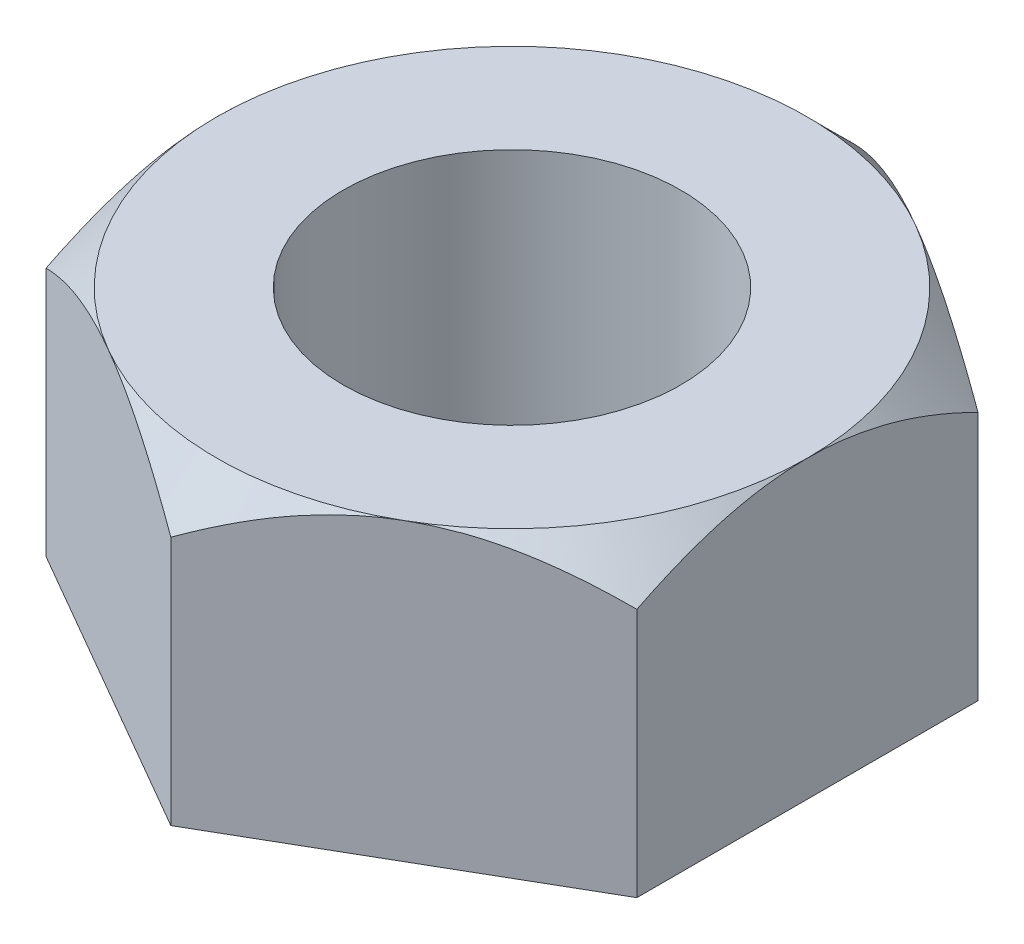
ISO-10303-21;
HEADER;
FILE_DESCRIPTION(('STEP AP214'),'2;1');
FILE_NAME('part.step','',(''),(''),'','','');
FILE_SCHEMA(('AUTOMOTIVE_DESIGN { 1 0 10303 214 1 1 1 1 }'));
ENDSEC;
DATA;
#1=APPLICATION_CONTEXT('core data for automotive mechanical design processes');
#2=APPLICATION_PROTOCOL_DEFINITION('international standard','automotive_design',2000,#1);
#3=PRODUCT_CONTEXT('',#1,'mechanical');
#4=PRODUCT('Part','Part','',(#3));
#5=PRODUCT_RELATED_PRODUCT_CATEGORY('part','',(#4));
#6=PRODUCT_DEFINITION_FORMATION('','',#4);
#7=PRODUCT_DEFINITION_CONTEXT('part definition',#1,'design');
#8=PRODUCT_DEFINITION('design','',#6,#7);
#9=PRODUCT_DEFINITION_SHAPE('','',#8);
#10=(LENGTH_UNIT() NAMED_UNIT(*) SI_UNIT(.MILLI.,.METRE.));
#11=(NAMED_UNIT(*) PLANE_ANGLE_UNIT() SI_UNIT($,.RADIAN.));
#12=(NAMED_UNIT(*) SI_UNIT($,.STERADIAN.) SOLID_ANGLE_UNIT());
#13=UNCERTAINTY_MEASURE_WITH_UNIT(LENGTH_MEASURE(1.E-05),#10,'distance_accuracy_value','');
#14=(GEOMETRIC_REPRESENTATION_CONTEXT(3) GLOBAL_UNCERTAINTY_ASSIGNED_CONTEXT((#13)) GLOBAL_UNIT_ASSIGNED_CONTEXT((#10,
#11,#12)) REPRESENTATION_CONTEXT('',''));
#15=CARTESIAN_POINT('',(0.,0.,0.));
#16=DIRECTION('',(0.,0.,1.));
#17=DIRECTION('',(1.,0.,0.));
#18=AXIS2_PLACEMENT_3D('',#15,#16,#17);
#19=CARTESIAN_POINT('',(5.5562499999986,5.55624999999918,-3.20790243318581));
#20=DIRECTION('',(-0.500000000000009,0.,0.866025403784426));
#21=DIRECTION('',(0.866025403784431,0.,0.499999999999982));
#22=AXIS2_PLACEMENT_3D('',#19,#20,#21);
#23=PLANE('',#22);
#24=CARTESIAN_POINT('',(5.5564499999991,4.69657966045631,-3.20778696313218));
#25=CARTESIAN_POINT('',(5.46091343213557,4.75173242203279,-3.26294502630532));
#26=CARTESIAN_POINT('',(5.36464252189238,4.80519263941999,-3.31852706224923));
#27=CARTESIAN_POINT('',(5.17048794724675,4.90821311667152,-3.43062225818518));
#28=CARTESIAN_POINT('',(5.07260343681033,4.95777124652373,-3.48713590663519));
#29=CARTESIAN_POINT('',(4.77540401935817,5.10024281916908,-3.65872407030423));
#30=CARTESIAN_POINT('',(4.57357316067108,5.18634564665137,-3.77525117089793));
#31=CARTESIAN_POINT('',(4.16656508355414,5.3337908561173,-4.01023739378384));
#32=CARTESIAN_POINT('',(3.96149189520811,5.39550470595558,-4.12863645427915));
#33=CARTESIAN_POINT('',(3.65051060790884,5.4668925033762,-4.30818158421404));
#34=CARTESIAN_POINT('',(3.54639232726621,5.48714839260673,-4.36829430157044));
#35=CARTESIAN_POINT('',(3.33727417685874,5.52014080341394,-4.48902872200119));
#36=CARTESIAN_POINT('',(3.23227444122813,5.53287844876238,-4.54965034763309));
#37=CARTESIAN_POINT('',(2.97640553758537,5.55423487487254,-4.69737632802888));
#38=CARTESIAN_POINT('',(2.82526068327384,5.55871592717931,-4.7846398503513));
#39=CARTESIAN_POINT('',(2.52324337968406,5.55119519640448,-4.95900962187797));
#40=CARTESIAN_POINT('',(2.37237104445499,5.53918763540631,-5.04611580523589));
#41=CARTESIAN_POINT('',(2.07204876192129,5.49939747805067,-5.2195069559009));
#42=CARTESIAN_POINT('',(1.92260059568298,5.47159724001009,-5.30579089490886));
#43=CARTESIAN_POINT('',(1.62627290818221,5.40173312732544,-5.47687576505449));
#44=CARTESIAN_POINT('',(1.4793931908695,5.35967034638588,-5.56167680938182));
#45=CARTESIAN_POINT('',(1.21865351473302,5.2731336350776,-5.71221493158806));
#46=CARTESIAN_POINT('',(1.10421623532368,5.23093545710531,-5.77828532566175));
#47=CARTESIAN_POINT('',(0.877395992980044,5.13973889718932,-5.90924005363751));
#48=CARTESIAN_POINT('',(0.765013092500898,5.09074030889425,-5.97412435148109));
#49=CARTESIAN_POINT('',(0.542655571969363,4.98704132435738,-6.10250252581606));
#50=CARTESIAN_POINT('',(0.432674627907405,4.93235885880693,-6.16600005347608));
#51=CARTESIAN_POINT('',(0.214749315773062,4.81801006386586,-6.29181929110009));
#52=CARTESIAN_POINT('',(0.106803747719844,4.75834679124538,-6.35414169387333));
#53=CARTESIAN_POINT('',(-0.000200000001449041,4.69657966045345,-6.41592033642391));
#54=B_SPLINE_CURVE_WITH_KNOTS('',3,(#24,#25,#26,#27,#28,#29,#30,#31,#32,#33,#34,#35,#36,#37,#38,
#39,#40,#41,#42,#43,#44,#45,#46,#47,#48,#49,#50,#51,#52,#53),.UNSPECIFIED.,.F.,.F.,(4,2,2,2,2,2,
2,2,2,2,2,2,2,2,4),(0.,0.369982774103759,0.740166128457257,1.48452951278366,2.21707291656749,
2.5826261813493,2.94812479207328,3.47106468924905,3.99418788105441,4.51789659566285,
5.04156515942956,5.45751515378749,5.87347777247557,6.28816585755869,6.7026012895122),.UNSPECIFIED.);
#55=CARTESIAN_POINT('',(5.55624999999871,4.69669513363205,-3.20790243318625));
#56=VERTEX_POINT('',#55);
#57=CARTESIAN_POINT('',(2.77812499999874,5.55624999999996,-4.81185364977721));
#58=VERTEX_POINT('',#57);
#59=EDGE_CURVE('E234',#56,#58,#54,.T.);
#60=ORIENTED_EDGE('',*,*,#59,.F.);
#61=DIRECTION('',(0.,-0.99999999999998,0.));
#62=VECTOR('',#61,1.);
#63=CARTESIAN_POINT('',(5.5562499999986,5.55624999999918,-3.20790243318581));
#64=LINE('',#63,#62);
#65=CARTESIAN_POINT('',(5.55624999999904,-1.66533453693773E-13,-3.20790243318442));
#66=VERTEX_POINT('',#65);
#67=EDGE_CURVE('E136',#56,#66,#64,.T.);
#68=ORIENTED_EDGE('',*,*,#67,.T.);
#69=DIRECTION('',(-0.866025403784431,0.,-0.499999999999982));
#70=VECTOR('',#69,1.);
#71=CARTESIAN_POINT('',(5.55624999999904,-1.66533453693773E-13,-3.20790243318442));
#72=LINE('',#71,#70);
#73=CARTESIAN_POINT('',(-1.4432899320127E-12,-1.11022302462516E-13,-6.41580486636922));
#74=VERTEX_POINT('',#73);
#75=EDGE_CURVE('E238',#66,#74,#72,.T.);
#76=ORIENTED_EDGE('',*,*,#75,.T.);
#77=DIRECTION('',(0.,-0.99999999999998,0.));
#78=VECTOR('',#77,1.);
#79=CARTESIAN_POINT('',(-1.4432899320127E-12,5.5562499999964,-6.415804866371));
#80=LINE('',#79,#78);
#81=CARTESIAN_POINT('',(-6.66133814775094E-13,4.69669513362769,-6.41580486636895));
#82=VERTEX_POINT('',#81);
#83=EDGE_CURVE('E140',#82,#74,#80,.T.);
#84=ORIENTED_EDGE('',*,*,#83,.F.);
#85=EDGE_CURVE('E166',#58,#82,#54,.T.);
#86=ORIENTED_EDGE('',*,*,#85,.F.);
#87=EDGE_LOOP('',(#60,#68,#76,#84,#86));
#88=FACE_BOUND('',#87,.T.);
#89=ADVANCED_FACE('F37',(#88),#23,.F.);
#90=CARTESIAN_POINT('',(-1.4432899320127E-12,5.5562499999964,-6.415804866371));
#91=DIRECTION('',(0.499999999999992,0.,0.866025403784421));
#92=DIRECTION('',(0.866025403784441,0.,-0.499999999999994));
#93=AXIS2_PLACEMENT_3D('',#90,#91,#92);
#94=PLANE('',#93);
#95=CARTESIAN_POINT('',(0.000199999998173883,4.69657966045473,-6.41592033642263));
#96=CARTESIAN_POINT('',(-0.0953365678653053,4.75173242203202,-6.36076227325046));
#97=CARTESIAN_POINT('',(-0.191607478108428,4.80519263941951,-6.30518023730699));
#98=CARTESIAN_POINT('',(-0.385762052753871,4.90821311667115,-6.19308504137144));
#99=CARTESIAN_POINT('',(-0.483646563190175,4.95777124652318,-6.13657139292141));
#100=CARTESIAN_POINT('',(-0.780845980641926,5.10024281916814,-5.96498322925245));
#101=CARTESIAN_POINT('',(-0.982676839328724,5.18634564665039,-5.848456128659));
#102=CARTESIAN_POINT('',(-1.38968491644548,5.33379085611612,-5.61346990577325));
#103=CARTESIAN_POINT('',(-1.59475810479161,5.39550470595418,-5.49507084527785));
#104=CARTESIAN_POINT('',(-1.90573939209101,5.46689250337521,-5.31552571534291));
#105=CARTESIAN_POINT('',(-2.00985767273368,5.48714839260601,-5.2554129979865));
#106=CARTESIAN_POINT('',(-2.21897582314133,5.52014080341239,-5.13467857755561));
#107=CARTESIAN_POINT('',(-2.32397555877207,5.53287844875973,-5.07405695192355));
#108=CARTESIAN_POINT('',(-2.57984446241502,5.5542348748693,-4.92633097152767));
#109=CARTESIAN_POINT('',(-2.73098931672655,5.55871592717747,-4.8390674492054));
#110=CARTESIAN_POINT('',(-3.03300662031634,5.55119519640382,-4.66469767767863));
#111=CARTESIAN_POINT('',(-3.18387895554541,5.53918763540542,-4.57759149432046));
#112=CARTESIAN_POINT('',(-3.48420123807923,5.49939747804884,-4.40420034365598));
#113=CARTESIAN_POINT('',(-3.63364940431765,5.47159724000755,-4.3179164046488));
#114=CARTESIAN_POINT('',(-3.92997709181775,5.40173312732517,-4.14683153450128));
#115=CARTESIAN_POINT('',(-4.07685680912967,5.35967034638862,-4.06203049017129));
#116=CARTESIAN_POINT('',(-4.33759648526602,5.27313363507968,-3.91149236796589));
#117=CARTESIAN_POINT('',(-4.45203376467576,5.23093545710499,-3.84542197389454));
#118=CARTESIAN_POINT('',(-4.67885400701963,5.13973889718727,-3.7144672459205));
#119=CARTESIAN_POINT('',(-4.79123690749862,5.09074030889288,-3.64958294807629));
#120=CARTESIAN_POINT('',(-5.01359442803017,4.98704132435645,-3.52120477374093));
#121=CARTESIAN_POINT('',(-5.12357537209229,4.93235885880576,-3.45770724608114));
#122=CARTESIAN_POINT('',(-5.34150068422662,4.81801006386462,-3.33188800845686));
#123=CARTESIAN_POINT('',(-5.44944625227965,4.75834679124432,-3.26956560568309));
#124=CARTESIAN_POINT('',(-5.55645000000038,4.69657966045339,-3.20778696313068));
#125=B_SPLINE_CURVE_WITH_KNOTS('',3,(#95,#96,#97,#98,#99,#100,#101,#102,#103,#104,#105,#106,
#107,#108,#109,#110,#111,#112,#113,#114,#115,#116,#117,#118,#119,#120,#121,#122,#123,#124),
.UNSPECIFIED.,.F.,.F.,(4,2,2,2,2,2,2,2,2,2,2,2,2,2,4),(0.,0.369982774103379,0.740166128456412,
1.48452951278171,2.21707291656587,2.58262618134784,2.94812479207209,3.47106468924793,
3.99418788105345,4.51789659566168,5.04156515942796,5.45751515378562,5.87347777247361,
6.28816585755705,6.70260128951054),.UNSPECIFIED.);
#126=CARTESIAN_POINT('',(-2.77812500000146,5.55624999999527,-4.81185364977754));
#127=VERTEX_POINT('',#126);
#128=EDGE_CURVE('E161',#82,#127,#125,.T.);
#129=ORIENTED_EDGE('',*,*,#128,.F.);
#130=ORIENTED_EDGE('',*,*,#83,.T.);
#131=DIRECTION('',(-0.866025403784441,0.,0.499999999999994));
#132=VECTOR('',#131,1.);
#133=CARTESIAN_POINT('',(-1.4432899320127E-12,-1.11022302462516E-13,-6.41580486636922));
#134=LINE('',#133,#132);
#135=CARTESIAN_POINT('',(-5.5562500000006,-7.21644966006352E-13,-3.2079024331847));
#136=VERTEX_POINT('',#135);
#137=EDGE_CURVE('E254',#74,#136,#134,.T.);
#138=ORIENTED_EDGE('',*,*,#137,.T.);
#139=DIRECTION('',(0.,-0.99999999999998,0.));
#140=VECTOR('',#139,1.);
#141=CARTESIAN_POINT('',(-5.55625000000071,5.55624999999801,-3.20790243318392));
#142=LINE('',#141,#140);
#143=CARTESIAN_POINT('',(-5.55625000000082,4.69669513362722,-3.20790243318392));
#144=VERTEX_POINT('',#143);
#145=EDGE_CURVE('E134',#144,#136,#142,.T.);
#146=ORIENTED_EDGE('',*,*,#145,.F.);
#147=EDGE_CURVE('E159',#127,#144,#125,.T.);
#148=ORIENTED_EDGE('',*,*,#147,.F.);
#149=EDGE_LOOP('',(#129,#130,#138,#146,#148));
#150=FACE_BOUND('',#149,.T.);
#151=ADVANCED_FACE('F160',(#150),#94,.F.);
#152=CARTESIAN_POINT('',(-5.55625000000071,5.55624999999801,-3.20790243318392));
#153=DIRECTION('',(1.,0.,0.));
#154=DIRECTION('',(0.,0.,-0.999999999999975));
#155=AXIS2_PLACEMENT_3D('',#152,#153,#154);
#156=PLANE('',#155);
#157=CARTESIAN_POINT('',(-5.55625000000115,2.4125023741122,-6.69462804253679));
#158=CARTESIAN_POINT('',(-5.55625000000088,2.53693227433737,-6.53288896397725));
#159=CARTESIAN_POINT('',(-5.55625000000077,2.66024718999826,-6.37027840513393));
#160=CARTESIAN_POINT('',(-5.55625000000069,2.90413765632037,-6.04295812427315));
#161=CARTESIAN_POINT('',(-5.55625000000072,3.02471255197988,-5.87824791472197));
#162=CARTESIAN_POINT('',(-5.55625000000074,3.26347164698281,-5.54516847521));
#163=CARTESIAN_POINT('',(-5.55625000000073,3.38163022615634,-5.37678081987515));
#164=CARTESIAN_POINT('',(-5.55625000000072,3.61383543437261,-5.03720304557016));
#165=CARTESIAN_POINT('',(-5.55625000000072,3.72788234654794,-4.86601312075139));
#166=CARTESIAN_POINT('',(-5.55625000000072,3.95799921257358,-4.5094004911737));
#167=CARTESIAN_POINT('',(-5.55625000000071,4.0737389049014,-4.3237635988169));
#168=CARTESIAN_POINT('',(-5.55625000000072,4.29803450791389,-3.94813041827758));
#169=CARTESIAN_POINT('',(-5.55625000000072,4.40658920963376,-3.75813340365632));
#170=CARTESIAN_POINT('',(-5.5562500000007,4.61420300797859,-3.37372800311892));
#171=CARTESIAN_POINT('',(-5.55625000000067,4.71328997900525,-3.17933479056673));
#172=CARTESIAN_POINT('',(-5.55625000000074,4.89974829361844,-2.78505305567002));
#173=CARTESIAN_POINT('',(-5.55625000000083,4.9871251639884,-2.5851671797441));
#174=CARTESIAN_POINT('',(-5.55625000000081,5.13910722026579,-2.19948175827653));
#175=CARTESIAN_POINT('',(-5.55625000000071,5.20510853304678,-2.01423801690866));
#176=CARTESIAN_POINT('',(-5.55625000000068,5.3222835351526,-1.63903108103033));
#177=CARTESIAN_POINT('',(-5.55625000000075,5.37345628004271,-1.44906758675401));
#178=CARTESIAN_POINT('',(-5.55625000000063,5.45735124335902,-1.0688641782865));
#179=CARTESIAN_POINT('',(-5.55625000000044,5.49040857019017,-0.878699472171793));
#180=CARTESIAN_POINT('',(-5.55625000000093,5.53738306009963,-0.496007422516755));
#181=CARTESIAN_POINT('',(-5.55625000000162,5.55130419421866,-0.303480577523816));
#182=CARTESIAN_POINT('',(-5.55625000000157,5.55882046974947,0.0735518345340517));
#183=CARTESIAN_POINT('',(-5.55625000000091,5.5532770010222,0.258040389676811));
#184=CARTESIAN_POINT('',(-5.55625000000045,5.52414759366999,0.625577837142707));
#185=CARTESIAN_POINT('',(-5.55625000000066,5.50056001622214,0.808626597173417));
#186=CARTESIAN_POINT('',(-5.55625000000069,5.43627517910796,1.17506191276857));
#187=CARTESIAN_POINT('',(-5.5562500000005,5.39527584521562,1.35839456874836));
#188=CARTESIAN_POINT('',(-5.55625000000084,5.29844208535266,1.72102257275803));
#189=CARTESIAN_POINT('',(-5.55625000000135,5.24260850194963,1.90031814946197));
#190=CARTESIAN_POINT('',(-5.55625000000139,5.11498441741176,2.26474953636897));
#191=CARTESIAN_POINT('',(-5.55625000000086,5.04245880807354,2.44962496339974));
#192=CARTESIAN_POINT('',(-5.55625000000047,4.88620286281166,2.814620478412));
#193=CARTESIAN_POINT('',(-5.55625000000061,4.80246747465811,2.99473837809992));
#194=CARTESIAN_POINT('',(-5.55625000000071,4.62577773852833,3.35106945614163));
#195=CARTESIAN_POINT('',(-5.55625000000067,4.53279499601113,3.52726843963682));
#196=CARTESIAN_POINT('',(-5.55625000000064,4.33965674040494,3.87562889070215));
#197=CARTESIAN_POINT('',(-5.55625000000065,4.23950233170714,4.04779097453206));
#198=CARTESIAN_POINT('',(-5.55625000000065,4.03850906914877,4.38019101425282));
#199=CARTESIAN_POINT('',(-5.55625000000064,3.93794824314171,4.54059797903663));
#200=CARTESIAN_POINT('',(-5.55625000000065,3.73254621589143,4.85865599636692));
#201=CARTESIAN_POINT('',(-5.55625000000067,3.62770469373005,5.01630684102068));
#202=CARTESIAN_POINT('',(-5.55625000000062,3.41535812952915,5.32794570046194));
#203=CARTESIAN_POINT('',(-5.55625000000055,3.30788123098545,5.48195296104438));
#204=CARTESIAN_POINT('',(-5.55625000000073,3.09004635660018,5.7878547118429));
#205=CARTESIAN_POINT('',(-5.55625000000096,2.97968918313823,5.93974977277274));
#206=CARTESIAN_POINT('',(-5.55625000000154,2.86815303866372,6.09075879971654));
#207=B_SPLINE_CURVE_WITH_KNOTS('',3,(#157,#158,#159,#160,#161,#162,#163,#164,#165,#166,#167,
#168,#169,#170,#171,#172,#173,#174,#175,#176,#177,#178,#179,#180,#181,#182,#183,#184,#185,#186,
#187,#188,#189,#190,#191,#192,#193,#194,#195,#196,#197,#198,#199,#200,#201,#202,#203,#204,#205,
#206),.UNSPECIFIED.,.F.,.F.,(4,2,2,2,2,2,2,2,2,2,2,2,2,2,2,2,2,2,2,2,2,2,2,2,4),(0.,
0.612204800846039,1.22455444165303,1.84162824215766,2.45865946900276,3.11481563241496,
3.77108192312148,4.42535234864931,5.07931288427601,5.6687559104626,6.25823647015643,
6.83640892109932,7.4144613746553,7.9672611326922,8.5201111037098,9.08297162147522,
9.64580017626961,10.2411205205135,10.8367100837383,11.4341884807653,12.0315750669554,
12.5994618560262,13.1673912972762,13.7307608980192,14.2939751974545),.UNSPECIFIED.);
#208=CARTESIAN_POINT('',(-5.55625000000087,5.55624999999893,-8.88178419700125E-13));
#209=VERTEX_POINT('',#208);
#210=EDGE_CURVE('E164',#144,#209,#207,.T.);
#211=ORIENTED_EDGE('',*,*,#210,.F.);
#212=ORIENTED_EDGE('',*,*,#145,.T.);
#213=DIRECTION('',(0.,0.,0.999999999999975));
#214=VECTOR('',#213,1.);
#215=CARTESIAN_POINT('',(-5.5562500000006,-7.21644966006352E-13,-3.2079024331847));
#216=LINE('',#215,#214);
#217=CARTESIAN_POINT('',(-5.55625000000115,-1.99840144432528E-12,3.20790243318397));
#218=VERTEX_POINT('',#217);
#219=EDGE_CURVE('E251',#136,#218,#216,.T.);
#220=ORIENTED_EDGE('',*,*,#219,.T.);
#221=DIRECTION('',(0.,-0.99999999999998,0.));
#222=VECTOR('',#221,1.);
#223=CARTESIAN_POINT('',(-5.55625000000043,5.55624999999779,3.20790243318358));
#224=LINE('',#223,#222);
#225=CARTESIAN_POINT('',(-5.55625000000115,4.6966951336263,3.2079024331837));
#226=VERTEX_POINT('',#225);
#227=EDGE_CURVE('E131',#226,#218,#224,.T.);
#228=ORIENTED_EDGE('',*,*,#227,.F.);
#229=EDGE_CURVE('E167',#209,#226,#207,.T.);
#230=ORIENTED_EDGE('',*,*,#229,.F.);
#231=EDGE_LOOP('',(#211,#212,#220,#228,#230));
#232=FACE_BOUND('',#231,.T.);
#233=ADVANCED_FACE('F221',(#232),#156,.F.);
#234=CARTESIAN_POINT('',(-5.55625000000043,5.55624999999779,3.20790243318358));
#235=DIRECTION('',(0.500000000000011,0.,-0.866025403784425));
#236=DIRECTION('',(-0.866025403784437,0.,-0.499999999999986));
#237=AXIS2_PLACEMENT_3D('',#234,#235,#236);
#238=PLANE('',#237);
#239=CARTESIAN_POINT('',(-5.55645000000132,4.69657966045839,3.20778696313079));
#240=CARTESIAN_POINT('',(-5.46091343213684,4.75173242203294,3.26294502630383));
#241=CARTESIAN_POINT('',(-5.36464252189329,4.80519263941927,3.31852706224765));
#242=CARTESIAN_POINT('',(-5.17048794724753,4.90821311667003,3.43062225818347));
#243=CARTESIAN_POINT('',(-5.07260343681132,4.95777124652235,3.48713590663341));
#244=CARTESIAN_POINT('',(-4.77540401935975,5.10024281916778,3.65872407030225));
#245=CARTESIAN_POINT('',(-4.57357316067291,5.18634564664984,3.77525117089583));
#246=CARTESIAN_POINT('',(-4.16656508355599,5.3337908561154,4.01023739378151));
#247=CARTESIAN_POINT('',(-3.96149189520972,5.39550470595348,4.12863645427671));
#248=CARTESIAN_POINT('',(-3.65051060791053,5.46689250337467,4.30818158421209));
#249=CARTESIAN_POINT('',(-3.54639232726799,5.48714839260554,4.36829430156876));
#250=CARTESIAN_POINT('',(-3.33727417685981,5.52014080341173,4.48902872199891));
#251=CARTESIAN_POINT('',(-3.2322744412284,5.53287844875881,4.54965034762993));
#252=CARTESIAN_POINT('',(-2.97640553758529,5.55423487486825,4.69737632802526));
#253=CARTESIAN_POINT('',(-2.82526068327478,5.55871592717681,4.78463985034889));
#254=CARTESIAN_POINT('',(-2.52324337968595,5.55119519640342,4.95900962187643));
#255=CARTESIAN_POINT('',(-2.37237104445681,5.53918763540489,5.04611580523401));
#256=CARTESIAN_POINT('',(-2.07204876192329,5.4993974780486,5.21950695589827));
#257=CARTESIAN_POINT('',(-1.92260059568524,5.47159724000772,5.30579089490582));
#258=CARTESIAN_POINT('',(-1.62627290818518,5.40173312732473,5.4768757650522));
#259=CARTESIAN_POINT('',(-1.47939319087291,5.35967034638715,5.56167680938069));
#260=CARTESIAN_POINT('',(-1.21865351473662,5.27313363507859,5.71221493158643));
#261=CARTESIAN_POINT('',(-1.1042162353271,5.23093545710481,5.77828532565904));
#262=CARTESIAN_POINT('',(-0.877395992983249,5.13973889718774,5.9092400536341));
#263=CARTESIAN_POINT('',(-0.765013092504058,5.09074030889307,5.97412435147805));
#264=CARTESIAN_POINT('',(-0.542655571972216,4.98704132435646,6.10250252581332));
#265=CARTESIAN_POINT('',(-0.432674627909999,4.93235885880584,6.16600005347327));
#266=CARTESIAN_POINT('',(-0.214749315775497,4.81801006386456,6.29181929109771));
#267=CARTESIAN_POINT('',(-0.106803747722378,4.75834679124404,6.35414169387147));
#268=CARTESIAN_POINT('',(0.000199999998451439,4.69657966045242,6.41592033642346));
#269=B_SPLINE_CURVE_WITH_KNOTS('',3,(#239,#240,#241,#242,#243,#244,#245,#246,#247,#248,#249,
#250,#251,#252,#253,#254,#255,#256,#257,#258,#259,#260,#261,#262,#263,#264,#265,#266,#267,#268),
.UNSPECIFIED.,.F.,.F.,(4,2,2,2,2,2,2,2,2,2,2,2,2,2,4),(0.,0.369982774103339,0.740166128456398,
1.48452951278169,2.21707291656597,2.58262618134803,2.94812479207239,3.47106468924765,
3.9941878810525,4.51789659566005,5.04156515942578,5.45751515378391,5.87347777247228,
6.28816585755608,6.70260128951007),.UNSPECIFIED.);
#270=CARTESIAN_POINT('',(-2.77812500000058,5.55624999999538,4.81185364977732));
#271=VERTEX_POINT('',#270);
#272=EDGE_CURVE('E116',#226,#271,#269,.T.);
#273=ORIENTED_EDGE('',*,*,#272,.F.);
#274=ORIENTED_EDGE('',*,*,#227,.T.);
#275=DIRECTION('',(0.866025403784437,0.,0.499999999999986));
#276=VECTOR('',#275,1.);
#277=CARTESIAN_POINT('',(-5.55625000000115,-1.99840144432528E-12,3.20790243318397));
#278=LINE('',#277,#276);
#279=CARTESIAN_POINT('',(-2.1094237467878E-12,9.43689570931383E-13,6.41580486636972));
#280=VERTEX_POINT('',#279);
#281=EDGE_CURVE('E129',#218,#280,#278,.T.);
#282=ORIENTED_EDGE('',*,*,#281,.T.);
#283=DIRECTION('',(0.,-0.99999999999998,0.));
#284=VECTOR('',#283,1.);
#285=CARTESIAN_POINT('',(-1.33226762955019E-12,5.55624999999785,6.41580486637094));
#286=LINE('',#285,#284);
#287=CARTESIAN_POINT('',(-1.22124532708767E-12,4.69669513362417,6.41580486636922));
#288=VERTEX_POINT('',#287);
#289=EDGE_CURVE('E122',#288,#280,#286,.T.);
#290=ORIENTED_EDGE('',*,*,#289,.F.);
#291=EDGE_CURVE('E108',#271,#288,#269,.T.);
#292=ORIENTED_EDGE('',*,*,#291,.F.);
#293=EDGE_LOOP('',(#273,#274,#282,#290,#292));
#294=FACE_BOUND('',#293,.T.);
#295=ADVANCED_FACE('F127',(#294),#238,.F.);
#296=CARTESIAN_POINT('',(-1.33226762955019E-12,5.55624999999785,6.41580486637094));
#297=DIRECTION('',(-0.499999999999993,0.,-0.866025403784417));
#298=DIRECTION('',(-0.866025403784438,0.,0.499999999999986));
#299=AXIS2_PLACEMENT_3D('',#296,#297,#298);
#300=PLANE('',#299);
#301=CARTESIAN_POINT('',(-0.000200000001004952,4.69657966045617,6.41592033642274));
#302=CARTESIAN_POINT('',(0.0953365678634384,4.75173242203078,6.36076227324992));
#303=CARTESIAN_POINT('',(0.191607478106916,4.80519263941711,6.30518023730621));
#304=CARTESIAN_POINT('',(0.38576205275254,4.90821311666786,6.19308504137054));
#305=CARTESIAN_POINT('',(0.48364656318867,4.95777124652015,6.13657139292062));
#306=CARTESIAN_POINT('',(0.780845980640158,5.10024281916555,5.96498322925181));
#307=CARTESIAN_POINT('',(0.982676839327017,5.18634564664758,5.84845612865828));
#308=CARTESIAN_POINT('',(1.38968491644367,5.33379085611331,5.61346990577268));
#309=CARTESIAN_POINT('',(1.59475810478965,5.39550470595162,5.49507084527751));
#310=CARTESIAN_POINT('',(1.90573939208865,5.46689250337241,5.31552571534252));
#311=CARTESIAN_POINT('',(2.00985767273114,5.48714839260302,5.25541299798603));
#312=CARTESIAN_POINT('',(2.21897582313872,5.52014080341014,5.13467857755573));
#313=CARTESIAN_POINT('',(2.32397555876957,5.53287844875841,5.07405695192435));
#314=CARTESIAN_POINT('',(2.5798444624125,5.55423487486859,4.92633097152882));
#315=CARTESIAN_POINT('',(2.73098931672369,5.5587159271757,4.83906744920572));
#316=CARTESIAN_POINT('',(3.03300662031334,5.55119519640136,4.66469767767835));
#317=CARTESIAN_POINT('',(3.18387895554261,5.53918763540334,4.57759149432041));
#318=CARTESIAN_POINT('',(3.48420123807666,5.49939747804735,4.40420034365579));
#319=CARTESIAN_POINT('',(3.6336494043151,5.47159724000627,4.31791640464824));
#320=CARTESIAN_POINT('',(3.92997709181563,5.40173312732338,4.1468315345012));
#321=CARTESIAN_POINT('',(4.07685680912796,5.35967034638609,4.06203049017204));
#322=CARTESIAN_POINT('',(4.33759648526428,5.2731336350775,3.91149236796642));
#323=CARTESIAN_POINT('',(4.45203376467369,5.23093545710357,3.84542197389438));
#324=CARTESIAN_POINT('',(4.67885400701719,5.13973889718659,3.71446724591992));
#325=CARTESIAN_POINT('',(4.79123690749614,5.09074030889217,3.64958294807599));
#326=CARTESIAN_POINT('',(5.01359442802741,4.98704132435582,3.5212047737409));
#327=CARTESIAN_POINT('',(5.1235753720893,4.93235885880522,3.45770724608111));
#328=CARTESIAN_POINT('',(5.34150068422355,4.81801006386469,3.33188800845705));
#329=CARTESIAN_POINT('',(5.44944625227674,4.75834679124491,3.26956560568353));
#330=CARTESIAN_POINT('',(5.5564499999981,4.69657966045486,3.20778696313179));
#331=B_SPLINE_CURVE_WITH_KNOTS('',3,(#301,#302,#303,#304,#305,#306,#307,#308,#309,#310,#311,
#312,#313,#314,#315,#316,#317,#318,#319,#320,#321,#322,#323,#324,#325,#326,#327,#328,#329,#330),
.UNSPECIFIED.,.F.,.F.,(4,2,2,2,2,2,2,2,2,2,2,2,2,2,4),(0.,0.36998277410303,0.740166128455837,
1.48452951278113,2.2170729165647,2.5826261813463,2.94812479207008,3.47106468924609,
3.99418788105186,4.51789659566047,5.04156515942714,5.45751515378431,5.87347777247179,
6.28816585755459,6.70260128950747),.UNSPECIFIED.);
#332=CARTESIAN_POINT('',(2.77812499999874,5.55624999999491,4.81185364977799));
#333=VERTEX_POINT('',#332);
#334=EDGE_CURVE('E111',#288,#333,#331,.T.);
#335=ORIENTED_EDGE('',*,*,#334,.F.);
#336=ORIENTED_EDGE('',*,*,#289,.T.);
#337=DIRECTION('',(0.866025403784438,0.,-0.499999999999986));
#338=VECTOR('',#337,1.);
#339=CARTESIAN_POINT('',(-2.1094237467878E-12,9.43689570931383E-13,6.41580486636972));
#340=LINE('',#339,#338);
#341=CARTESIAN_POINT('',(5.55624999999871,-4.02455846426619E-12,3.20790243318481));
#342=VERTEX_POINT('',#341);
#343=EDGE_CURVE('E246',#280,#342,#340,.T.);
#344=ORIENTED_EDGE('',*,*,#343,.T.);
#345=DIRECTION('',(0.,-0.99999999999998,0.));
#346=VECTOR('',#345,1.);
#347=CARTESIAN_POINT('',(5.55624999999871,5.55624999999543,3.2079024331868));
#348=LINE('',#347,#346);
#349=CARTESIAN_POINT('',(5.55624999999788,4.69669513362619,3.20790243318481));
#350=VERTEX_POINT('',#349);
#351=EDGE_CURVE('E132',#350,#342,#348,.T.);
#352=ORIENTED_EDGE('',*,*,#351,.F.);
#353=EDGE_CURVE('E125',#333,#350,#331,.T.);
#354=ORIENTED_EDGE('',*,*,#353,.F.);
#355=EDGE_LOOP('',(#335,#336,#344,#352,#354));
#356=FACE_BOUND('',#355,.T.);
#357=ADVANCED_FACE('F120',(#356),#300,.F.);
#358=CARTESIAN_POINT('',(5.55624999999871,5.55624999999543,3.2079024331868));
#359=DIRECTION('',(-1.,0.,0.));
#360=DIRECTION('',(0.,0.,0.999999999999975));
#361=AXIS2_PLACEMENT_3D('',#358,#359,#360);
#362=PLANE('',#361);
#363=CARTESIAN_POINT('',(5.55624999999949,2.41250237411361,-6.69462804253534));
#364=CARTESIAN_POINT('',(5.55624999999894,2.53693227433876,-6.53288896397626));
#365=CARTESIAN_POINT('',(5.55624999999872,2.66024718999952,-6.3702784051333));
#366=CARTESIAN_POINT('',(5.55624999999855,2.90413765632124,-6.04295812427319));
#367=CARTESIAN_POINT('',(5.55624999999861,3.0247125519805,-5.87824791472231));
#368=CARTESIAN_POINT('',(5.55624999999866,3.26347164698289,-5.54516847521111));
#369=CARTESIAN_POINT('',(5.55624999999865,3.38163022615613,-5.37678081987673));
#370=CARTESIAN_POINT('',(5.55624999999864,3.61383543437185,-5.03720304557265));
#371=CARTESIAN_POINT('',(5.55624999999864,3.72788234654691,-4.86601312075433));
#372=CARTESIAN_POINT('',(5.55624999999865,3.95799921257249,-4.50940049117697));
#373=CARTESIAN_POINT('',(5.55624999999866,4.07373890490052,-4.32376359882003));
#374=CARTESIAN_POINT('',(5.55624999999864,4.29803450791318,-3.9481304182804));
#375=CARTESIAN_POINT('',(5.55624999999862,4.40658920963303,-3.75813340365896));
#376=CARTESIAN_POINT('',(5.55624999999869,4.61420300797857,-3.37372800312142));
#377=CARTESIAN_POINT('',(5.55624999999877,4.71328997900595,-3.17933479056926));
#378=CARTESIAN_POINT('',(5.55624999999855,4.89974829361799,-2.78505305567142));
#379=CARTESIAN_POINT('',(5.55624999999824,4.98712516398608,-2.58516717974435));
#380=CARTESIAN_POINT('',(5.55624999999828,5.13910722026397,-2.19948175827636));
#381=CARTESIAN_POINT('',(5.55624999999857,5.20510853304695,-2.01423801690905));
#382=CARTESIAN_POINT('',(5.55624999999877,5.32228353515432,-1.63903108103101));
#383=CARTESIAN_POINT('',(5.55624999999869,5.373456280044,-1.44906758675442));
#384=CARTESIAN_POINT('',(5.55624999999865,5.45735124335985,-1.0688641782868));
#385=CARTESIAN_POINT('',(5.55624999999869,5.49040857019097,-0.878699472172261));
#386=CARTESIAN_POINT('',(5.55624999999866,5.53738306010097,-0.496007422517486));
#387=CARTESIAN_POINT('',(5.5562499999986,5.55130419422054,-0.303480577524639));
#388=CARTESIAN_POINT('',(5.5562499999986,5.55882046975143,0.0735518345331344));
#389=CARTESIAN_POINT('',(5.55624999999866,5.55327700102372,0.258040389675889));
#390=CARTESIAN_POINT('',(5.55624999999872,5.52414759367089,0.625577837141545));
#391=CARTESIAN_POINT('',(5.55624999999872,5.50056001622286,0.808626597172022));
#392=CARTESIAN_POINT('',(5.55624999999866,5.43627517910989,1.17506191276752));
#393=CARTESIAN_POINT('',(5.55624999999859,5.39527584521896,1.35839456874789));
#394=CARTESIAN_POINT('',(5.5562499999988,5.29844208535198,1.72102257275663));
#395=CARTESIAN_POINT('',(5.55624999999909,5.24260850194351,1.90031814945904));
#396=CARTESIAN_POINT('',(5.55624999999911,5.11498441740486,2.26474953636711));
#397=CARTESIAN_POINT('',(5.55624999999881,5.04245880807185,2.44962496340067));
#398=CARTESIAN_POINT('',(5.5562499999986,4.8862028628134,2.81462047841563));
#399=CARTESIAN_POINT('',(5.55624999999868,4.80246747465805,2.99473837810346));
#400=CARTESIAN_POINT('',(5.55624999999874,4.62577773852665,3.35106945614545));
#401=CARTESIAN_POINT('',(5.55624999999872,4.53279499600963,3.52726843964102));
#402=CARTESIAN_POINT('',(5.5562499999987,4.33965674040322,3.87562889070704));
#403=CARTESIAN_POINT('',(5.55624999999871,4.239502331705,4.04779097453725));
#404=CARTESIAN_POINT('',(5.55624999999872,4.0385090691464,4.38019101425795));
#405=CARTESIAN_POINT('',(5.55624999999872,3.93794824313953,4.5405979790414));
#406=CARTESIAN_POINT('',(5.55624999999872,3.73254621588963,4.85865599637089));
#407=CARTESIAN_POINT('',(5.55624999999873,3.62770469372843,5.01630684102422));
#408=CARTESIAN_POINT('',(5.55624999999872,3.41535812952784,5.32794570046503));
#409=CARTESIAN_POINT('',(5.5562499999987,3.30788123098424,5.48195296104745));
#410=CARTESIAN_POINT('',(5.55624999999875,3.09004635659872,5.7878547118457));
#411=CARTESIAN_POINT('',(5.55624999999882,2.97968918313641,5.93974977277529));
#412=CARTESIAN_POINT('',(5.55624999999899,2.86815303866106,6.09075879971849));
#413=B_SPLINE_CURVE_WITH_KNOTS('',3,(#363,#364,#365,#366,#367,#368,#369,#370,#371,#372,#373,
#374,#375,#376,#377,#378,#379,#380,#381,#382,#383,#384,#385,#386,#387,#388,#389,#390,#391,#392,
#393,#394,#395,#396,#397,#398,#399,#400,#401,#402,#403,#404,#405,#406,#407,#408,#409,#410,#411,
#412),.UNSPECIFIED.,.F.,.F.,(4,2,2,2,2,2,2,2,2,2,2,2,2,2,2,2,2,2,2,2,2,2,2,2,4),(0.,
0.612204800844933,1.22455444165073,1.84162824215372,2.45865946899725,3.11481563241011,
3.77108192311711,4.42535234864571,5.07931288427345,5.66875591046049,6.25823647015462,
6.83640892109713,7.41446137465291,7.96726113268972,8.52011110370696,9.08297162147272,
9.6458001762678,10.241120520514,10.8367100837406,11.4341884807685,12.0315750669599,
12.5994618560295,13.1673912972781,13.7307608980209,14.2939751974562),.UNSPECIFIED.);
#414=CARTESIAN_POINT('',(5.55624999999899,5.55624999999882,-8.88178419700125E-13));
#415=VERTEX_POINT('',#414);
#416=EDGE_CURVE('E276',#350,#415,#413,.F.);
#417=ORIENTED_EDGE('',*,*,#416,.F.);
#418=ORIENTED_EDGE('',*,*,#351,.T.);
#419=DIRECTION('',(0.,0.,-0.999999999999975));
#420=VECTOR('',#419,1.);
#421=CARTESIAN_POINT('',(5.55624999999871,-4.02455846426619E-12,3.20790243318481));
#422=LINE('',#421,#420);
#423=EDGE_CURVE('E244',#342,#66,#422,.T.);
#424=ORIENTED_EDGE('',*,*,#423,.T.);
#425=ORIENTED_EDGE('',*,*,#67,.F.);
#426=EDGE_CURVE('E199',#415,#56,#413,.F.);
#427=ORIENTED_EDGE('',*,*,#426,.F.);
#428=EDGE_LOOP('',(#417,#418,#424,#425,#427));
#429=FACE_BOUND('',#428,.T.);
#430=ADVANCED_FACE('F242',(#429),#362,.F.);
#431=CARTESIAN_POINT('',(-1.4432899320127E-12,-1.11022302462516E-13,-6.41580486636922));
#432=DIRECTION('',(0.,0.99999999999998,0.));
#433=DIRECTION('',(0.,0.,0.999999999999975));
#434=AXIS2_PLACEMENT_3D('',#431,#432,#433);
#435=PLANE('',#434);
#436=CARTESIAN_POINT('',(0.,0.,0.));
#437=DIRECTION('',(0.,0.99999999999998,0.));
#438=DIRECTION('',(0.,0.,0.999999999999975));
#439=AXIS2_PLACEMENT_3D('',#436,#437,#438);
#440=CIRCLE('',#439,3.175);
#441=CARTESIAN_POINT('',(0.,0.,3.17499999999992));
#442=VERTEX_POINT('',#441);
#443=EDGE_CURVE('E277',#442,#442,#440,.T.);
#444=ORIENTED_EDGE('',*,*,#443,.T.);
#445=EDGE_LOOP('',(#444));
#446=FACE_BOUND('',#445,.T.);
#447=ORIENTED_EDGE('',*,*,#75,.F.);
#448=ORIENTED_EDGE('',*,*,#423,.F.);
#449=ORIENTED_EDGE('',*,*,#343,.F.);
#450=ORIENTED_EDGE('',*,*,#281,.F.);
#451=ORIENTED_EDGE('',*,*,#219,.F.);
#452=ORIENTED_EDGE('',*,*,#137,.F.);
#453=EDGE_LOOP('',(#447,#448,#449,#450,#451,#452));
#454=FACE_BOUND('',#453,.T.);
#455=ADVANCED_FACE('F256',(#446,#454),#435,.F.);
#456=CARTESIAN_POINT('',(-4.44089209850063E-13,5.5562499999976,-1.83186799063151E-12));
#457=DIRECTION('',(0.,-0.99999999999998,0.));
#458=DIRECTION('',(0.,0.,-0.999999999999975));
#459=AXIS2_PLACEMENT_3D('',#456,#457,#458);
#460=CONICAL_SURFACE('',#459,5.55625,0.785398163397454);
#461=ORIENTED_EDGE('',*,*,#291,.T.);
#462=ORIENTED_EDGE('',*,*,#334,.T.);
#463=CARTESIAN_POINT('',(-4.44089209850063E-13,5.5562499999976,-1.83186799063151E-12));
#464=DIRECTION('',(0.,0.99999999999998,0.));
#465=DIRECTION('',(0.,0.,0.999999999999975));
#466=AXIS2_PLACEMENT_3D('',#463,#464,#465);
#467=CIRCLE('',#466,5.55625);
#468=EDGE_CURVE('E41',#271,#333,#467,.T.);
#469=ORIENTED_EDGE('',*,*,#468,.F.);
#470=EDGE_LOOP('',(#461,#462,#469));
#471=FACE_BOUND('',#470,.T.);
#472=ADVANCED_FACE('F110',(#471),#460,.T.);
#473=ORIENTED_EDGE('',*,*,#229,.T.);
#474=ORIENTED_EDGE('',*,*,#272,.T.);
#475=EDGE_CURVE('E146',#209,#271,#467,.T.);
#476=ORIENTED_EDGE('',*,*,#475,.F.);
#477=EDGE_LOOP('',(#473,#474,#476));
#478=FACE_BOUND('',#477,.T.);
#479=ADVANCED_FACE('F261',(#478),#460,.T.);
#480=ORIENTED_EDGE('',*,*,#147,.T.);
#481=ORIENTED_EDGE('',*,*,#210,.T.);
#482=EDGE_CURVE('E147',#127,#209,#467,.T.);
#483=ORIENTED_EDGE('',*,*,#482,.F.);
#484=EDGE_LOOP('',(#480,#481,#483));
#485=FACE_BOUND('',#484,.T.);
#486=ADVANCED_FACE('F259',(#485),#460,.T.);
#487=ORIENTED_EDGE('',*,*,#85,.T.);
#488=ORIENTED_EDGE('',*,*,#128,.T.);
#489=EDGE_CURVE('E46',#58,#127,#467,.T.);
#490=ORIENTED_EDGE('',*,*,#489,.F.);
#491=EDGE_LOOP('',(#487,#488,#490));
#492=FACE_BOUND('',#491,.T.);
#493=ADVANCED_FACE('F192',(#492),#460,.T.);
#494=ORIENTED_EDGE('',*,*,#59,.T.);
#495=EDGE_CURVE('E12',#415,#58,#467,.T.);
#496=ORIENTED_EDGE('',*,*,#495,.F.);
#497=ORIENTED_EDGE('',*,*,#426,.T.);
#498=EDGE_LOOP('',(#494,#496,#497));
#499=FACE_BOUND('',#498,.T.);
#500=ADVANCED_FACE('F186',(#499),#460,.T.);
#501=ORIENTED_EDGE('',*,*,#353,.T.);
#502=ORIENTED_EDGE('',*,*,#416,.T.);
#503=CARTESIAN_POINT('',(-4.44089209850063E-13,5.5562499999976,-1.83186799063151E-12));
#504=DIRECTION('',(0.,0.99999999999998,0.));
#505=DIRECTION('',(0.,0.,0.999999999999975));
#506=AXIS2_PLACEMENT_3D('',#503,#504,#505);
#507=CIRCLE('',#506,5.55625);
#508=EDGE_CURVE('E53',#333,#415,#507,.T.);
#509=ORIENTED_EDGE('',*,*,#508,.F.);
#510=EDGE_LOOP('',(#501,#502,#509));
#511=FACE_BOUND('',#510,.T.);
#512=ADVANCED_FACE('F191',(#511),#460,.T.);
#513=CARTESIAN_POINT('',(-1.4432899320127E-12,5.5562499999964,-6.415804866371));
#514=DIRECTION('',(0.,0.99999999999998,0.));
#515=DIRECTION('',(0.,0.,0.999999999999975));
#516=AXIS2_PLACEMENT_3D('',#513,#514,#515);
#517=PLANE('',#516);
#518=CARTESIAN_POINT('',(-4.44089209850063E-13,5.5562499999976,-1.83186799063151E-12));
#519=DIRECTION('',(0.,0.99999999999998,0.));
#520=DIRECTION('',(0.,0.,0.999999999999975));
#521=AXIS2_PLACEMENT_3D('',#518,#519,#520);
#522=CIRCLE('',#521,3.175);
#523=CARTESIAN_POINT('',(0.,5.55624999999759,3.17499999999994));
#524=VERTEX_POINT('',#523);
#525=EDGE_CURVE('E279',#524,#524,#522,.T.);
#526=ORIENTED_EDGE('',*,*,#525,.F.);
#527=EDGE_LOOP('',(#526));
#528=FACE_BOUND('',#527,.T.);
#529=ORIENTED_EDGE('',*,*,#468,.T.);
#530=ORIENTED_EDGE('',*,*,#508,.T.);
#531=ORIENTED_EDGE('',*,*,#495,.T.);
#532=ORIENTED_EDGE('',*,*,#489,.T.);
#533=ORIENTED_EDGE('',*,*,#482,.T.);
#534=ORIENTED_EDGE('',*,*,#475,.T.);
#535=EDGE_LOOP('',(#529,#530,#531,#532,#533,#534));
#536=FACE_BOUND('',#535,.T.);
#537=ADVANCED_FACE('F155',(#528,#536),#517,.T.);
#538=CARTESIAN_POINT('',(0.,0.,0.));
#539=DIRECTION('',(0.,0.99999999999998,0.));
#540=DIRECTION('',(0.,0.,0.999999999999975));
#541=AXIS2_PLACEMENT_3D('',#538,#539,#540);
#542=CYLINDRICAL_SURFACE('',#541,3.175);
#543=CARTESIAN_POINT('',(0.,0.,3.17499999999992));
#544=CARTESIAN_POINT('',(0.,0.0578776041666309,3.17499999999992));
#545=CARTESIAN_POINT('',(0.,0.115755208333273,3.17499999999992));
#546=CARTESIAN_POINT('',(0.,0.231510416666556,3.17499999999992));
#547=CARTESIAN_POINT('',(0.,0.289388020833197,3.17499999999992));
#548=CARTESIAN_POINT('',(0.,0.405143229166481,3.17499999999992));
#549=CARTESIAN_POINT('',(0.,0.463020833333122,3.17499999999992));
#550=CARTESIAN_POINT('',(0.,0.578776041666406,3.17499999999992));
#551=CARTESIAN_POINT('',(0.,0.636653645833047,3.17499999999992));
#552=CARTESIAN_POINT('',(0.,0.752408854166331,3.17499999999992));
#553=CARTESIAN_POINT('',(0.,0.810286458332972,3.17499999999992));
#554=CARTESIAN_POINT('',(0.,0.926041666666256,3.17499999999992));
#555=CARTESIAN_POINT('',(0.,0.983919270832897,3.17499999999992));
#556=CARTESIAN_POINT('',(0.,1.09967447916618,3.17499999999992));
#557=CARTESIAN_POINT('',(0.,1.15755208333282,3.17499999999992));
#558=CARTESIAN_POINT('',(0.,1.27330729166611,3.17499999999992));
#559=CARTESIAN_POINT('',(0.,1.33118489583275,3.17499999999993));
#560=CARTESIAN_POINT('',(0.,1.44694010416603,3.17499999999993));
#561=CARTESIAN_POINT('',(0.,1.50481770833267,3.17499999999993));
#562=CARTESIAN_POINT('',(0.,1.62057291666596,3.17499999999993));
#563=CARTESIAN_POINT('',(0.,1.6784505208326,3.17499999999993));
#564=CARTESIAN_POINT('',(0.,1.79420572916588,3.17499999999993));
#565=CARTESIAN_POINT('',(0.,1.85208333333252,3.17499999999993));
#566=CARTESIAN_POINT('',(0.,1.96783854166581,3.17499999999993));
#567=CARTESIAN_POINT('',(0.,2.02571614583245,3.17499999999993));
#568=CARTESIAN_POINT('',(0.,2.14147135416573,3.17499999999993));
#569=CARTESIAN_POINT('',(0.,2.19934895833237,3.17499999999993));
#570=CARTESIAN_POINT('',(0.,2.31510416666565,3.17499999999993));
#571=CARTESIAN_POINT('',(0.,2.3729817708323,3.17499999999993));
#572=CARTESIAN_POINT('',(0.,2.48873697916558,3.17499999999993));
#573=CARTESIAN_POINT('',(0.,2.54661458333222,3.17499999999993));
#574=CARTESIAN_POINT('',(0.,2.6623697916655,3.17499999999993));
#575=CARTESIAN_POINT('',(0.,2.72024739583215,3.17499999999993));
#576=CARTESIAN_POINT('',(0.,2.83600260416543,3.17499999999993));
#577=CARTESIAN_POINT('',(0.,2.89388020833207,3.17499999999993));
#578=CARTESIAN_POINT('',(0.,3.00963541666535,3.17499999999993));
#579=CARTESIAN_POINT('',(0.,3.067513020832,3.17499999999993));
#580=CARTESIAN_POINT('',(0.,3.18326822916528,3.17499999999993));
#581=CARTESIAN_POINT('',(0.,3.24114583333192,3.17499999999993));
#582=CARTESIAN_POINT('',(0.,3.3569010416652,3.17499999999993));
#583=CARTESIAN_POINT('',(0.,3.41477864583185,3.17499999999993));
#584=CARTESIAN_POINT('',(0.,3.53053385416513,3.17499999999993));
#585=CARTESIAN_POINT('',(0.,3.58841145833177,3.17499999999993));
#586=CARTESIAN_POINT('',(0.,3.70416666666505,3.17499999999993));
#587=CARTESIAN_POINT('',(0.,3.7620442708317,3.17499999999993));
#588=CARTESIAN_POINT('',(0.,3.87779947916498,3.17499999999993));
#589=CARTESIAN_POINT('',(0.,3.93567708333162,3.17499999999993));
#590=CARTESIAN_POINT('',(0.,4.0514322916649,3.17499999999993));
#591=CARTESIAN_POINT('',(0.,4.10930989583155,3.17499999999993));
#592=CARTESIAN_POINT('',(0.,4.22506510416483,3.17499999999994));
#593=CARTESIAN_POINT('',(0.,4.28294270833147,3.17499999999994));
#594=CARTESIAN_POINT('',(0.,4.39869791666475,3.17499999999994));
#595=CARTESIAN_POINT('',(0.,4.4565755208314,3.17499999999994));
#596=CARTESIAN_POINT('',(0.,4.57233072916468,3.17499999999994));
#597=CARTESIAN_POINT('',(0.,4.63020833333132,3.17499999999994));
#598=CARTESIAN_POINT('',(0.,4.7459635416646,3.17499999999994));
#599=CARTESIAN_POINT('',(0.,4.80384114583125,3.17499999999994));
#600=CARTESIAN_POINT('',(0.,4.91959635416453,3.17499999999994));
#601=CARTESIAN_POINT('',(0.,4.97747395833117,3.17499999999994));
#602=CARTESIAN_POINT('',(0.,5.09322916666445,3.17499999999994));
#603=CARTESIAN_POINT('',(0.,5.1511067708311,3.17499999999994));
#604=CARTESIAN_POINT('',(0.,5.26686197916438,3.17499999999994));
#605=CARTESIAN_POINT('',(0.,5.32473958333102,3.17499999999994));
#606=CARTESIAN_POINT('',(0.,5.4404947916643,3.17499999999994));
#607=CARTESIAN_POINT('',(0.,5.49837239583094,3.17499999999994));
#608=CARTESIAN_POINT('',(0.,5.55624999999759,3.17499999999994));
#609=B_SPLINE_CURVE_WITH_KNOTS('',3,(#543,#544,#545,#546,#547,#548,#549,#550,#551,#552,#553,
#554,#555,#556,#557,#558,#559,#560,#561,#562,#563,#564,#565,#566,#567,#568,#569,#570,#571,#572,
#573,#574,#575,#576,#577,#578,#579,#580,#581,#582,#583,#584,#585,#586,#587,#588,#589,#590,#591,
#592,#593,#594,#595,#596,#597,#598,#599,#600,#601,#602,#603,#604,#605,#606,#607,#608),
.UNSPECIFIED.,.F.,.F.,(4,2,2,2,2,2,2,2,2,2,2,2,2,2,2,2,2,2,2,2,2,2,2,2,2,2,2,2,2,2,2,2,4),(0.,
0.173632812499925,0.34726562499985,0.520898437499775,0.6945312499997,0.868164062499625,
1.04179687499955,1.21542968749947,1.3890624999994,1.56269531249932,1.73632812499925,
1.90996093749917,2.0835937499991,2.25722656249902,2.43085937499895,2.60449218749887,
2.7781249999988,2.95175781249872,3.12539062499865,3.29902343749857,3.4726562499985,
3.64628906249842,3.81992187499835,3.99355468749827,4.1671874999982,4.34082031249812,
4.51445312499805,4.68808593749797,4.8617187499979,5.03535156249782,5.20898437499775,
5.38261718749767,5.5562499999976),.UNSPECIFIED.);
#610=EDGE_CURVE('BSEAM194',#442,#524,#609,.T.);
#611=ORIENTED_EDGE('',*,*,#443,.F.);
#612=ORIENTED_EDGE('',*,*,#525,.T.);
#613=ORIENTED_EDGE('',*,*,#610,.T.);
#614=ORIENTED_EDGE('',*,*,#610,.F.);
#615=EDGE_LOOP('',(#611,#613,#612,#614));
#616=FACE_BOUND('',#615,.T.);
#617=ADVANCED_FACE('F194',(#616),#542,.F.);
#618=CLOSED_SHELL('',(#89,#151,#233,#295,#357,#430,#455,#472,#479,#486,#493,#500,#512,#537,#617));
#619=MANIFOLD_SOLID_BREP('B2',#618);
#620=ADVANCED_BREP_SHAPE_REPRESENTATION('',(#18,#619),#14);
#621=SHAPE_DEFINITION_REPRESENTATION(#9,#620);
ENDSEC;
END-ISO-10303-21;
